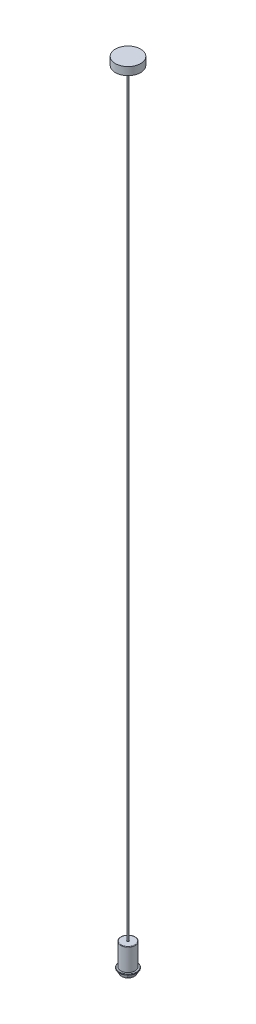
ISO-10303-21;
HEADER;
FILE_DESCRIPTION(('STEP AP214'),'2;1');
FILE_NAME('part.step','',(''),(''),'','','');
FILE_SCHEMA(('AUTOMOTIVE_DESIGN { 1 0 10303 214 1 1 1 1 }'));
ENDSEC;
DATA;
#1=APPLICATION_CONTEXT('core data for automotive mechanical design processes');
#2=APPLICATION_PROTOCOL_DEFINITION('international standard','automotive_design',2000,#1);
#3=PRODUCT_CONTEXT('',#1,'mechanical');
#4=PRODUCT('Part','Part','',(#3));
#5=PRODUCT_RELATED_PRODUCT_CATEGORY('part','',(#4));
#6=PRODUCT_DEFINITION_FORMATION('','',#4);
#7=PRODUCT_DEFINITION_CONTEXT('part definition',#1,'design');
#8=PRODUCT_DEFINITION('design','',#6,#7);
#9=PRODUCT_DEFINITION_SHAPE('','',#8);
#10=(LENGTH_UNIT() NAMED_UNIT(*) SI_UNIT(.MILLI.,.METRE.));
#11=(NAMED_UNIT(*) PLANE_ANGLE_UNIT() SI_UNIT($,.RADIAN.));
#12=(NAMED_UNIT(*) SI_UNIT($,.STERADIAN.) SOLID_ANGLE_UNIT());
#13=UNCERTAINTY_MEASURE_WITH_UNIT(LENGTH_MEASURE(1.E-05),#10,'distance_accuracy_value','');
#14=(GEOMETRIC_REPRESENTATION_CONTEXT(3) GLOBAL_UNCERTAINTY_ASSIGNED_CONTEXT((#13)) GLOBAL_UNIT_ASSIGNED_CONTEXT((#10,
#11,#12)) REPRESENTATION_CONTEXT('',''));
#15=CARTESIAN_POINT('',(0.,0.,0.));
#16=DIRECTION('',(0.,0.,1.));
#17=DIRECTION('',(1.,0.,0.));
#18=AXIS2_PLACEMENT_3D('',#15,#16,#17);
#19=CARTESIAN_POINT('',(0.,-4.3,0.));
#20=DIRECTION('',(0.,1.,0.));
#21=DIRECTION('',(0.,0.,1.));
#22=AXIS2_PLACEMENT_3D('',#19,#20,#21);
#23=CYLINDRICAL_SURFACE('',#22,28.);
#24=CARTESIAN_POINT('',(0.,-1.8,0.));
#25=DIRECTION('',(0.,-1.,0.));
#26=DIRECTION('',(0.,0.,-1.));
#27=AXIS2_PLACEMENT_3D('',#24,#25,#26);
#28=CIRCLE('',#27,28.);
#29=CARTESIAN_POINT('',(0.,-1.8,-28.));
#30=VERTEX_POINT('',#29);
#31=EDGE_CURVE('E58',#30,#30,#28,.T.);
#32=ORIENTED_EDGE('',*,*,#31,.T.);
#33=EDGE_LOOP('',(#32));
#34=FACE_BOUND('',#33,.T.);
#35=CARTESIAN_POINT('',(0.,-3.3,0.));
#36=DIRECTION('',(0.,-1.,0.));
#37=DIRECTION('',(0.,0.,-1.));
#38=AXIS2_PLACEMENT_3D('',#35,#36,#37);
#39=CIRCLE('',#38,28.);
#40=CARTESIAN_POINT('',(0.,-3.3,-28.));
#41=VERTEX_POINT('',#40);
#42=EDGE_CURVE('E62',#41,#41,#39,.F.);
#43=ORIENTED_EDGE('',*,*,#42,.T.);
#44=EDGE_LOOP('',(#43));
#45=FACE_BOUND('',#44,.T.);
#46=ADVANCED_FACE('F47',(#34,#45),#23,.T.);
#47=CARTESIAN_POINT('',(0.,-4.3,0.));
#48=DIRECTION('',(0.,-1.,0.));
#49=DIRECTION('',(0.,0.,-1.));
#50=AXIS2_PLACEMENT_3D('',#47,#48,#49);
#51=PLANE('',#50);
#52=CARTESIAN_POINT('',(0.,-4.3,0.));
#53=DIRECTION('',(0.,-1.,0.));
#54=DIRECTION('',(0.,0.,-1.));
#55=AXIS2_PLACEMENT_3D('',#52,#53,#54);
#56=CIRCLE('',#55,23.);
#57=CARTESIAN_POINT('',(0.,-4.3,-23.));
#58=VERTEX_POINT('',#57);
#59=EDGE_CURVE('E68',#58,#58,#56,.T.);
#60=ORIENTED_EDGE('',*,*,#59,.F.);
#61=EDGE_LOOP('',(#60));
#62=FACE_BOUND('',#61,.T.);
#63=CARTESIAN_POINT('',(0.,-4.3,0.));
#64=DIRECTION('',(0.,-1.,0.));
#65=DIRECTION('',(0.,0.,-1.));
#66=AXIS2_PLACEMENT_3D('',#63,#64,#65);
#67=CIRCLE('',#66,27.);
#68=CARTESIAN_POINT('',(0.,-4.3,-27.));
#69=VERTEX_POINT('',#68);
#70=EDGE_CURVE('E11',#69,#69,#67,.T.);
#71=ORIENTED_EDGE('',*,*,#70,.T.);
#72=EDGE_LOOP('',(#71));
#73=FACE_BOUND('',#72,.T.);
#74=ADVANCED_FACE('F85',(#62,#73),#51,.T.);
#75=CARTESIAN_POINT('',(0.,-0.8,0.));
#76=DIRECTION('',(0.,-1.,0.));
#77=DIRECTION('',(0.,0.,-1.));
#78=AXIS2_PLACEMENT_3D('',#75,#76,#77);
#79=PLANE('',#78);
#80=CARTESIAN_POINT('',(0.,-0.799999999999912,0.));
#81=DIRECTION('',(0.,-1.,0.));
#82=DIRECTION('',(0.,0.,-1.));
#83=AXIS2_PLACEMENT_3D('',#80,#81,#82);
#84=CIRCLE('',#83,20.);
#85=CARTESIAN_POINT('',(0.,-0.799999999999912,-20.));
#86=VERTEX_POINT('',#85);
#87=EDGE_CURVE('E76',#86,#86,#84,.F.);
#88=ORIENTED_EDGE('',*,*,#87,.F.);
#89=EDGE_LOOP('',(#88));
#90=FACE_BOUND('',#89,.T.);
#91=CARTESIAN_POINT('',(0.,-0.8,0.));
#92=DIRECTION('',(0.,-1.,0.));
#93=DIRECTION('',(0.,0.,-1.));
#94=AXIS2_PLACEMENT_3D('',#91,#92,#93);
#95=CIRCLE('',#94,27.);
#96=CARTESIAN_POINT('',(0.,-0.8,-27.));
#97=VERTEX_POINT('',#96);
#98=EDGE_CURVE('E54',#97,#97,#95,.F.);
#99=ORIENTED_EDGE('',*,*,#98,.T.);
#100=EDGE_LOOP('',(#99));
#101=FACE_BOUND('',#100,.T.);
#102=ADVANCED_FACE('F82',(#90,#101),#79,.F.);
#103=CARTESIAN_POINT('',(0.,-1.8,0.));
#104=DIRECTION('',(0.,-1.,0.));
#105=DIRECTION('',(0.,0.,-1.));
#106=AXIS2_PLACEMENT_3D('',#103,#104,#105);
#107=TOROIDAL_SURFACE('',#106,27.,1.);
#108=ORIENTED_EDGE('',*,*,#98,.F.);
#109=EDGE_LOOP('',(#108));
#110=FACE_BOUND('',#109,.T.);
#111=ORIENTED_EDGE('',*,*,#31,.F.);
#112=EDGE_LOOP('',(#111));
#113=FACE_BOUND('',#112,.T.);
#114=ADVANCED_FACE('F84',(#110,#113),#107,.T.);
#115=CARTESIAN_POINT('',(0.,-3.3,0.));
#116=DIRECTION('',(0.,-1.,0.));
#117=DIRECTION('',(0.,0.,-1.));
#118=AXIS2_PLACEMENT_3D('',#115,#116,#117);
#119=TOROIDAL_SURFACE('',#118,27.,1.);
#120=ORIENTED_EDGE('',*,*,#42,.F.);
#121=EDGE_LOOP('',(#120));
#122=FACE_BOUND('',#121,.T.);
#123=ORIENTED_EDGE('',*,*,#70,.F.);
#124=EDGE_LOOP('',(#123));
#125=FACE_BOUND('',#124,.T.);
#126=ADVANCED_FACE('F49',(#122,#125),#119,.T.);
#127=CARTESIAN_POINT('',(0.,-12.3,0.));
#128=DIRECTION('',(0.,-1.,0.));
#129=DIRECTION('',(0.,0.,-1.));
#130=AXIS2_PLACEMENT_3D('',#127,#128,#129);
#131=PLANE('',#130);
#132=CARTESIAN_POINT('',(0.,-12.3,0.));
#133=DIRECTION('',(0.,-1.,0.));
#134=DIRECTION('',(0.,0.,-1.));
#135=AXIS2_PLACEMENT_3D('',#132,#133,#134);
#136=CIRCLE('',#135,23.);
#137=CARTESIAN_POINT('',(0.,-12.3,-23.));
#138=VERTEX_POINT('',#137);
#139=EDGE_CURVE('E67',#138,#138,#136,.T.);
#140=ORIENTED_EDGE('',*,*,#139,.T.);
#141=EDGE_LOOP('',(#140));
#142=FACE_BOUND('',#141,.T.);
#143=CARTESIAN_POINT('',(0.,-12.3,0.));
#144=DIRECTION('',(0.,-1.,0.));
#145=DIRECTION('',(0.,0.,-1.));
#146=AXIS2_PLACEMENT_3D('',#143,#144,#145);
#147=CIRCLE('',#146,20.);
#148=CARTESIAN_POINT('',(0.,-12.3,-20.));
#149=VERTEX_POINT('',#148);
#150=EDGE_CURVE('E71',#149,#149,#147,.T.);
#151=ORIENTED_EDGE('',*,*,#150,.F.);
#152=EDGE_LOOP('',(#151));
#153=FACE_BOUND('',#152,.T.);
#154=ADVANCED_FACE('F105',(#142,#153),#131,.T.);
#155=CARTESIAN_POINT('',(0.,-12.3,0.));
#156=DIRECTION('',(0.,1.,0.));
#157=DIRECTION('',(0.,0.,1.));
#158=AXIS2_PLACEMENT_3D('',#155,#156,#157);
#159=CYLINDRICAL_SURFACE('',#158,23.);
#160=ORIENTED_EDGE('',*,*,#139,.F.);
#161=EDGE_LOOP('',(#160));
#162=FACE_BOUND('',#161,.T.);
#163=ORIENTED_EDGE('',*,*,#59,.T.);
#164=EDGE_LOOP('',(#163));
#165=FACE_BOUND('',#164,.T.);
#166=ADVANCED_FACE('F109',(#162,#165),#159,.T.);
#167=CARTESIAN_POINT('',(0.,-12.3,0.));
#168=DIRECTION('',(0.,1.,0.));
#169=DIRECTION('',(0.,0.,1.));
#170=AXIS2_PLACEMENT_3D('',#167,#168,#169);
#171=CYLINDRICAL_SURFACE('',#170,20.);
#172=ORIENTED_EDGE('',*,*,#150,.T.);
#173=EDGE_LOOP('',(#172));
#174=FACE_BOUND('',#173,.T.);
#175=ORIENTED_EDGE('',*,*,#87,.T.);
#176=EDGE_LOOP('',(#175));
#177=FACE_BOUND('',#176,.T.);
#178=ADVANCED_FACE('F80',(#174,#177),#171,.F.);
#179=CLOSED_SHELL('',(#46,#74,#102,#114,#126,#154,#166,#178));
#180=MANIFOLD_SOLID_BREP('B2',#179);
#181=CARTESIAN_POINT('',(0.,71.,0.));
#182=DIRECTION('',(0.,-1.,0.));
#183=DIRECTION('',(0.,0.,-1.));
#184=AXIS2_PLACEMENT_3D('',#181,#182,#183);
#185=CYLINDRICAL_SURFACE('',#184,23.);
#186=CARTESIAN_POINT('',(0.,69.5,0.));
#187=DIRECTION('',(0.,1.,0.));
#188=DIRECTION('',(0.,0.,1.));
#189=AXIS2_PLACEMENT_3D('',#186,#187,#188);
#190=CIRCLE('',#189,23.);
#191=CARTESIAN_POINT('',(0.,69.5,23.));
#192=VERTEX_POINT('',#191);
#193=EDGE_CURVE('E46',#192,#192,#190,.F.);
#194=ORIENTED_EDGE('',*,*,#193,.T.);
#195=EDGE_LOOP('',(#194));
#196=FACE_BOUND('',#195,.T.);
#197=CARTESIAN_POINT('',(0.,0.,0.));
#198=DIRECTION('',(0.,1.,0.));
#199=DIRECTION('',(0.,0.,1.));
#200=AXIS2_PLACEMENT_3D('',#197,#198,#199);
#201=CIRCLE('',#200,23.);
#202=CARTESIAN_POINT('',(0.,0.,23.));
#203=VERTEX_POINT('',#202);
#204=EDGE_CURVE('E185',#203,#203,#201,.T.);
#205=ORIENTED_EDGE('',*,*,#204,.T.);
#206=EDGE_LOOP('',(#205));
#207=FACE_BOUND('',#206,.T.);
#208=ADVANCED_FACE('F172',(#196,#207),#185,.T.);
#209=CARTESIAN_POINT('',(0.,71.,0.));
#210=DIRECTION('',(0.,1.,0.));
#211=DIRECTION('',(0.,0.,1.));
#212=AXIS2_PLACEMENT_3D('',#209,#210,#211);
#213=PLANE('',#212);
#214=CARTESIAN_POINT('',(0.,71.,0.));
#215=DIRECTION('',(0.,1.,0.));
#216=DIRECTION('',(0.,0.,1.));
#217=AXIS2_PLACEMENT_3D('',#214,#215,#216);
#218=CIRCLE('',#217,3.5);
#219=CARTESIAN_POINT('',(0.,71.,3.5));
#220=VERTEX_POINT('',#219);
#221=EDGE_CURVE('E193',#220,#220,#218,.T.);
#222=ORIENTED_EDGE('',*,*,#221,.F.);
#223=EDGE_LOOP('',(#222));
#224=FACE_BOUND('',#223,.T.);
#225=CARTESIAN_POINT('',(0.,71.,0.));
#226=DIRECTION('',(0.,1.,0.));
#227=DIRECTION('',(0.,0.,1.));
#228=AXIS2_PLACEMENT_3D('',#225,#226,#227);
#229=CIRCLE('',#228,21.5);
#230=CARTESIAN_POINT('',(0.,71.,21.5));
#231=VERTEX_POINT('',#230);
#232=EDGE_CURVE('E180',#231,#231,#229,.T.);
#233=ORIENTED_EDGE('',*,*,#232,.T.);
#234=EDGE_LOOP('',(#233));
#235=FACE_BOUND('',#234,.T.);
#236=ADVANCED_FACE('F293',(#224,#235),#213,.T.);
#237=CARTESIAN_POINT('',(0.,0.,0.));
#238=DIRECTION('',(0.,1.,0.));
#239=DIRECTION('',(0.,0.,1.));
#240=AXIS2_PLACEMENT_3D('',#237,#238,#239);
#241=PLANE('',#240);
#242=CARTESIAN_POINT('',(0.,0.,0.));
#243=DIRECTION('',(0.,-1.,0.));
#244=DIRECTION('',(0.,0.,-1.));
#245=AXIS2_PLACEMENT_3D('',#242,#243,#244);
#246=CIRCLE('',#245,22.5);
#247=CARTESIAN_POINT('',(0.,0.,-22.5));
#248=VERTEX_POINT('',#247);
#249=EDGE_CURVE('E233',#248,#248,#246,.T.);
#250=ORIENTED_EDGE('',*,*,#249,.F.);
#251=EDGE_LOOP('',(#250));
#252=FACE_BOUND('',#251,.T.);
#253=ORIENTED_EDGE('',*,*,#204,.F.);
#254=EDGE_LOOP('',(#253));
#255=FACE_BOUND('',#254,.T.);
#256=ADVANCED_FACE('F290',(#252,#255),#241,.F.);
#257=CARTESIAN_POINT('',(0.,69.5,0.));
#258=DIRECTION('',(0.,1.,0.));
#259=DIRECTION('',(0.,0.,1.));
#260=AXIS2_PLACEMENT_3D('',#257,#258,#259);
#261=TOROIDAL_SURFACE('',#260,21.5,1.5);
#262=ORIENTED_EDGE('',*,*,#193,.F.);
#263=EDGE_LOOP('',(#262));
#264=FACE_BOUND('',#263,.T.);
#265=ORIENTED_EDGE('',*,*,#232,.F.);
#266=EDGE_LOOP('',(#265));
#267=FACE_BOUND('',#266,.T.);
#268=ADVANCED_FACE('F174',(#264,#267),#261,.T.);
#269=CARTESIAN_POINT('',(0.,69.5,0.));
#270=DIRECTION('',(0.,1.,0.));
#271=DIRECTION('',(0.,0.,1.));
#272=AXIS2_PLACEMENT_3D('',#269,#270,#271);
#273=CYLINDRICAL_SURFACE('',#272,3.5);
#274=CARTESIAN_POINT('',(0.,69.5,0.));
#275=DIRECTION('',(0.,1.,0.));
#276=DIRECTION('',(0.,0.,1.));
#277=AXIS2_PLACEMENT_3D('',#274,#275,#276);
#278=CIRCLE('',#277,3.5);
#279=CARTESIAN_POINT('',(0.,69.5,3.5));
#280=VERTEX_POINT('',#279);
#281=EDGE_CURVE('E190',#280,#280,#278,.T.);
#282=ORIENTED_EDGE('',*,*,#281,.F.);
#283=EDGE_LOOP('',(#282));
#284=FACE_BOUND('',#283,.T.);
#285=ORIENTED_EDGE('',*,*,#221,.T.);
#286=EDGE_LOOP('',(#285));
#287=FACE_BOUND('',#286,.T.);
#288=ADVANCED_FACE('F304',(#284,#287),#273,.F.);
#289=CARTESIAN_POINT('',(0.,69.5,0.));
#290=DIRECTION('',(0.,1.,0.));
#291=DIRECTION('',(0.,0.,1.));
#292=AXIS2_PLACEMENT_3D('',#289,#290,#291);
#293=PLANE('',#292);
#294=CARTESIAN_POINT('',(0.,69.5,0.));
#295=DIRECTION('',(0.,1.,0.));
#296=DIRECTION('',(0.,0.,1.));
#297=AXIS2_PLACEMENT_3D('',#294,#295,#296);
#298=CIRCLE('',#297,2.5);
#299=CARTESIAN_POINT('',(0.,69.5,2.5));
#300=VERTEX_POINT('',#299);
#301=EDGE_CURVE('E201',#300,#300,#298,.T.);
#302=ORIENTED_EDGE('',*,*,#301,.F.);
#303=EDGE_LOOP('',(#302));
#304=FACE_BOUND('',#303,.T.);
#305=ORIENTED_EDGE('',*,*,#281,.T.);
#306=EDGE_LOOP('',(#305));
#307=FACE_BOUND('',#306,.T.);
#308=ADVANCED_FACE('F307',(#304,#307),#293,.T.);
#309=CARTESIAN_POINT('',(0.,66.5,0.));
#310=DIRECTION('',(0.,1.,0.));
#311=DIRECTION('',(0.,0.,1.));
#312=AXIS2_PLACEMENT_3D('',#309,#310,#311);
#313=CYLINDRICAL_SURFACE('',#312,2.5);
#314=CARTESIAN_POINT('',(0.,66.5,0.));
#315=DIRECTION('',(0.,1.,0.));
#316=DIRECTION('',(0.,0.,1.));
#317=AXIS2_PLACEMENT_3D('',#314,#315,#316);
#318=CIRCLE('',#317,2.5);
#319=CARTESIAN_POINT('',(0.,66.5,2.5));
#320=VERTEX_POINT('',#319);
#321=EDGE_CURVE('E197',#320,#320,#318,.T.);
#322=ORIENTED_EDGE('',*,*,#321,.F.);
#323=EDGE_LOOP('',(#322));
#324=FACE_BOUND('',#323,.T.);
#325=ORIENTED_EDGE('',*,*,#301,.T.);
#326=EDGE_LOOP('',(#325));
#327=FACE_BOUND('',#326,.T.);
#328=ADVANCED_FACE('F311',(#324,#327),#313,.F.);
#329=CARTESIAN_POINT('',(0.,66.5,0.));
#330=DIRECTION('',(0.,1.,0.));
#331=DIRECTION('',(0.,0.,1.));
#332=AXIS2_PLACEMENT_3D('',#329,#330,#331);
#333=PLANE('',#332);
#334=CARTESIAN_POINT('',(0.,66.5,0.));
#335=DIRECTION('',(0.,1.,0.));
#336=DIRECTION('',(0.,0.,1.));
#337=AXIS2_PLACEMENT_3D('',#334,#335,#336);
#338=CIRCLE('',#337,2.);
#339=CARTESIAN_POINT('',(0.,66.5,2.));
#340=VERTEX_POINT('',#339);
#341=EDGE_CURVE('E209',#340,#340,#338,.T.);
#342=ORIENTED_EDGE('',*,*,#341,.F.);
#343=EDGE_LOOP('',(#342));
#344=FACE_BOUND('',#343,.T.);
#345=ORIENTED_EDGE('',*,*,#321,.T.);
#346=EDGE_LOOP('',(#345));
#347=FACE_BOUND('',#346,.T.);
#348=ADVANCED_FACE('F315',(#344,#347),#333,.T.);
#349=CARTESIAN_POINT('',(0.,2466.5,0.));
#350=DIRECTION('',(0.,-1.,0.));
#351=DIRECTION('',(0.,0.,-1.));
#352=AXIS2_PLACEMENT_3D('',#349,#350,#351);
#353=CYLINDRICAL_SURFACE('',#352,2.);
#354=CARTESIAN_POINT('',(0.,2466.5,0.));
#355=DIRECTION('',(0.,1.,0.));
#356=DIRECTION('',(0.,0.,1.));
#357=AXIS2_PLACEMENT_3D('',#354,#355,#356);
#358=CIRCLE('',#357,2.);
#359=CARTESIAN_POINT('',(0.,2466.5,2.));
#360=VERTEX_POINT('',#359);
#361=EDGE_CURVE('E205',#360,#360,#358,.T.);
#362=ORIENTED_EDGE('',*,*,#361,.F.);
#363=EDGE_LOOP('',(#362));
#364=FACE_BOUND('',#363,.T.);
#365=ORIENTED_EDGE('',*,*,#341,.T.);
#366=EDGE_LOOP('',(#365));
#367=FACE_BOUND('',#366,.T.);
#368=ADVANCED_FACE('F319',(#364,#367),#353,.T.);
#369=CARTESIAN_POINT('',(0.,2476.5,0.));
#370=DIRECTION('',(0.,-1.,0.));
#371=DIRECTION('',(0.,0.,-1.));
#372=AXIS2_PLACEMENT_3D('',#369,#370,#371);
#373=CYLINDRICAL_SURFACE('',#372,6.5);
#374=CARTESIAN_POINT('',(0.,2476.5,0.));
#375=DIRECTION('',(0.,1.,0.));
#376=DIRECTION('',(0.,0.,1.));
#377=AXIS2_PLACEMENT_3D('',#374,#375,#376);
#378=CIRCLE('',#377,6.5);
#379=CARTESIAN_POINT('',(0.,2476.5,6.5));
#380=VERTEX_POINT('',#379);
#381=EDGE_CURVE('E213',#380,#380,#378,.T.);
#382=ORIENTED_EDGE('',*,*,#381,.F.);
#383=EDGE_LOOP('',(#382));
#384=FACE_BOUND('',#383,.T.);
#385=CARTESIAN_POINT('',(0.,2466.5,0.));
#386=DIRECTION('',(0.,1.,0.));
#387=DIRECTION('',(0.,0.,1.));
#388=AXIS2_PLACEMENT_3D('',#385,#386,#387);
#389=CIRCLE('',#388,6.5);
#390=CARTESIAN_POINT('',(0.,2466.5,6.5));
#391=VERTEX_POINT('',#390);
#392=EDGE_CURVE('E217',#391,#391,#389,.T.);
#393=ORIENTED_EDGE('',*,*,#392,.T.);
#394=EDGE_LOOP('',(#393));
#395=FACE_BOUND('',#394,.T.);
#396=ADVANCED_FACE('F323',(#384,#395),#373,.T.);
#397=CARTESIAN_POINT('',(0.,2466.5,0.));
#398=DIRECTION('',(0.,1.,0.));
#399=DIRECTION('',(0.,0.,1.));
#400=AXIS2_PLACEMENT_3D('',#397,#398,#399);
#401=PLANE('',#400);
#402=ORIENTED_EDGE('',*,*,#361,.T.);
#403=EDGE_LOOP('',(#402));
#404=FACE_BOUND('',#403,.T.);
#405=ORIENTED_EDGE('',*,*,#392,.F.);
#406=EDGE_LOOP('',(#405));
#407=FACE_BOUND('',#406,.T.);
#408=ADVANCED_FACE('F327',(#404,#407),#401,.F.);
#409=CARTESIAN_POINT('',(0.,2501.5,0.));
#410=DIRECTION('',(0.,-1.,0.));
#411=DIRECTION('',(0.,0.,-1.));
#412=AXIS2_PLACEMENT_3D('',#409,#410,#411);
#413=CYLINDRICAL_SURFACE('',#412,40.);
#414=CARTESIAN_POINT('',(0.,2501.5,0.));
#415=DIRECTION('',(0.,1.,0.));
#416=DIRECTION('',(0.,0.,1.));
#417=AXIS2_PLACEMENT_3D('',#414,#415,#416);
#418=CIRCLE('',#417,40.);
#419=CARTESIAN_POINT('',(0.,2501.5,40.));
#420=VERTEX_POINT('',#419);
#421=EDGE_CURVE('E221',#420,#420,#418,.T.);
#422=ORIENTED_EDGE('',*,*,#421,.F.);
#423=EDGE_LOOP('',(#422));
#424=FACE_BOUND('',#423,.T.);
#425=CARTESIAN_POINT('',(0.,2476.5,0.));
#426=DIRECTION('',(0.,1.,0.));
#427=DIRECTION('',(0.,0.,1.));
#428=AXIS2_PLACEMENT_3D('',#425,#426,#427);
#429=CIRCLE('',#428,40.);
#430=CARTESIAN_POINT('',(0.,2476.5,40.));
#431=VERTEX_POINT('',#430);
#432=EDGE_CURVE('E225',#431,#431,#429,.T.);
#433=ORIENTED_EDGE('',*,*,#432,.T.);
#434=EDGE_LOOP('',(#433));
#435=FACE_BOUND('',#434,.T.);
#436=ADVANCED_FACE('F331',(#424,#435),#413,.T.);
#437=CARTESIAN_POINT('',(0.,2501.5,0.));
#438=DIRECTION('',(0.,1.,0.));
#439=DIRECTION('',(0.,0.,1.));
#440=AXIS2_PLACEMENT_3D('',#437,#438,#439);
#441=PLANE('',#440);
#442=ORIENTED_EDGE('',*,*,#421,.T.);
#443=EDGE_LOOP('',(#442));
#444=FACE_BOUND('',#443,.T.);
#445=ADVANCED_FACE('F335',(#444),#441,.T.);
#446=CARTESIAN_POINT('',(0.,2476.5,0.));
#447=DIRECTION('',(0.,1.,0.));
#448=DIRECTION('',(0.,0.,1.));
#449=AXIS2_PLACEMENT_3D('',#446,#447,#448);
#450=PLANE('',#449);
#451=ORIENTED_EDGE('',*,*,#381,.T.);
#452=EDGE_LOOP('',(#451));
#453=FACE_BOUND('',#452,.T.);
#454=ORIENTED_EDGE('',*,*,#432,.F.);
#455=EDGE_LOOP('',(#454));
#456=FACE_BOUND('',#455,.T.);
#457=ADVANCED_FACE('F286',(#453,#456),#450,.F.);
#458=CARTESIAN_POINT('',(0.,35.,0.));
#459=DIRECTION('',(0.,-1.,0.));
#460=DIRECTION('',(0.,0.,-1.));
#461=AXIS2_PLACEMENT_3D('',#458,#459,#460);
#462=CYLINDRICAL_SURFACE('',#461,22.5);
#463=CARTESIAN_POINT('',(0.,35.,0.));
#464=DIRECTION('',(0.,-1.,0.));
#465=DIRECTION('',(0.,0.,-1.));
#466=AXIS2_PLACEMENT_3D('',#463,#464,#465);
#467=CIRCLE('',#466,22.5);
#468=CARTESIAN_POINT('',(0.,35.,-22.5));
#469=VERTEX_POINT('',#468);
#470=EDGE_CURVE('E229',#469,#469,#467,.T.);
#471=ORIENTED_EDGE('',*,*,#470,.F.);
#472=EDGE_LOOP('',(#471));
#473=FACE_BOUND('',#472,.T.);
#474=ORIENTED_EDGE('',*,*,#249,.T.);
#475=EDGE_LOOP('',(#474));
#476=FACE_BOUND('',#475,.T.);
#477=ADVANCED_FACE('F280',(#473,#476),#462,.F.);
#478=CARTESIAN_POINT('',(0.,35.,0.));
#479=DIRECTION('',(0.,-1.,0.));
#480=DIRECTION('',(0.,0.,-1.));
#481=AXIS2_PLACEMENT_3D('',#478,#479,#480);
#482=PLANE('',#481);
#483=CARTESIAN_POINT('',(0.,35.,0.));
#484=DIRECTION('',(0.,-1.,0.));
#485=DIRECTION('',(0.,0.,-1.));
#486=AXIS2_PLACEMENT_3D('',#483,#484,#485);
#487=CIRCLE('',#486,20.);
#488=CARTESIAN_POINT('',(0.,35.,20.));
#489=VERTEX_POINT('',#488);
#490=EDGE_CURVE('E241',#489,#489,#487,.T.);
#491=ORIENTED_EDGE('',*,*,#490,.F.);
#492=EDGE_LOOP('',(#491));
#493=FACE_BOUND('',#492,.T.);
#494=ORIENTED_EDGE('',*,*,#470,.T.);
#495=EDGE_LOOP('',(#494));
#496=FACE_BOUND('',#495,.T.);
#497=ADVANCED_FACE('F274',(#493,#496),#482,.T.);
#498=CARTESIAN_POINT('',(0.,-17.,0.));
#499=DIRECTION('',(0.,1.,0.));
#500=DIRECTION('',(0.,0.,1.));
#501=AXIS2_PLACEMENT_3D('',#498,#499,#500);
#502=CYLINDRICAL_SURFACE('',#501,20.);
#503=CARTESIAN_POINT('',(0.,-17.,0.));
#504=DIRECTION('',(0.,-1.,0.));
#505=DIRECTION('',(0.,0.,-1.));
#506=AXIS2_PLACEMENT_3D('',#503,#504,#505);
#507=CIRCLE('',#506,20.);
#508=CARTESIAN_POINT('',(0.,-17.,20.));
#509=VERTEX_POINT('',#508);
#510=EDGE_CURVE('E237',#509,#509,#507,.T.);
#511=CARTESIAN_POINT('',(0.,-17.,20.));
#512=CARTESIAN_POINT('',(0.,-16.4583333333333,20.));
#513=CARTESIAN_POINT('',(0.,-15.9166666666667,20.));
#514=CARTESIAN_POINT('',(0.,-14.8333333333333,20.));
#515=CARTESIAN_POINT('',(0.,-14.2916666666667,20.));
#516=CARTESIAN_POINT('',(0.,-13.2083333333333,20.));
#517=CARTESIAN_POINT('',(0.,-12.6666666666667,20.));
#518=CARTESIAN_POINT('',(0.,-11.5833333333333,20.));
#519=CARTESIAN_POINT('',(0.,-11.0416666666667,20.));
#520=CARTESIAN_POINT('',(0.,-9.95833333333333,20.));
#521=CARTESIAN_POINT('',(0.,-9.41666666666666,20.));
#522=CARTESIAN_POINT('',(0.,-8.33333333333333,20.));
#523=CARTESIAN_POINT('',(0.,-7.79166666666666,20.));
#524=CARTESIAN_POINT('',(0.,-6.70833333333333,20.));
#525=CARTESIAN_POINT('',(0.,-6.16666666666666,20.));
#526=CARTESIAN_POINT('',(0.,-5.08333333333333,20.));
#527=CARTESIAN_POINT('',(0.,-4.54166666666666,20.));
#528=CARTESIAN_POINT('',(0.,-3.45833333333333,20.));
#529=CARTESIAN_POINT('',(0.,-2.91666666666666,20.));
#530=CARTESIAN_POINT('',(0.,-1.83333333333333,20.));
#531=CARTESIAN_POINT('',(0.,-1.29166666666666,20.));
#532=CARTESIAN_POINT('',(0.,-0.208333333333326,20.));
#533=CARTESIAN_POINT('',(0.,0.333333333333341,20.));
#534=CARTESIAN_POINT('',(0.,1.41666666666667,20.));
#535=CARTESIAN_POINT('',(0.,1.95833333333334,20.));
#536=CARTESIAN_POINT('',(0.,3.04166666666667,20.));
#537=CARTESIAN_POINT('',(0.,3.58333333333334,20.));
#538=CARTESIAN_POINT('',(0.,4.66666666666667,20.));
#539=CARTESIAN_POINT('',(0.,5.20833333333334,20.));
#540=CARTESIAN_POINT('',(0.,6.29166666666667,20.));
#541=CARTESIAN_POINT('',(0.,6.83333333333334,20.));
#542=CARTESIAN_POINT('',(0.,7.91666666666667,20.));
#543=CARTESIAN_POINT('',(0.,8.45833333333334,20.));
#544=CARTESIAN_POINT('',(0.,9.54166666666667,20.));
#545=CARTESIAN_POINT('',(0.,10.0833333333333,20.));
#546=CARTESIAN_POINT('',(0.,11.1666666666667,20.));
#547=CARTESIAN_POINT('',(0.,11.7083333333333,20.));
#548=CARTESIAN_POINT('',(0.,12.7916666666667,20.));
#549=CARTESIAN_POINT('',(0.,13.3333333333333,20.));
#550=CARTESIAN_POINT('',(0.,14.4166666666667,20.));
#551=CARTESIAN_POINT('',(0.,14.9583333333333,20.));
#552=CARTESIAN_POINT('',(0.,16.0416666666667,20.));
#553=CARTESIAN_POINT('',(0.,16.5833333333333,20.));
#554=CARTESIAN_POINT('',(0.,17.6666666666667,20.));
#555=CARTESIAN_POINT('',(0.,18.2083333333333,20.));
#556=CARTESIAN_POINT('',(0.,19.2916666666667,20.));
#557=CARTESIAN_POINT('',(0.,19.8333333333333,20.));
#558=CARTESIAN_POINT('',(0.,20.9166666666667,20.));
#559=CARTESIAN_POINT('',(0.,21.4583333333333,20.));
#560=CARTESIAN_POINT('',(0.,22.5416666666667,20.));
#561=CARTESIAN_POINT('',(0.,23.0833333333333,20.));
#562=CARTESIAN_POINT('',(0.,24.1666666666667,20.));
#563=CARTESIAN_POINT('',(0.,24.7083333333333,20.));
#564=CARTESIAN_POINT('',(0.,25.7916666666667,20.));
#565=CARTESIAN_POINT('',(0.,26.3333333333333,20.));
#566=CARTESIAN_POINT('',(0.,27.4166666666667,20.));
#567=CARTESIAN_POINT('',(0.,27.9583333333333,20.));
#568=CARTESIAN_POINT('',(0.,29.0416666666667,20.));
#569=CARTESIAN_POINT('',(0.,29.5833333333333,20.));
#570=CARTESIAN_POINT('',(0.,30.6666666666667,20.));
#571=CARTESIAN_POINT('',(0.,31.2083333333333,20.));
#572=CARTESIAN_POINT('',(0.,32.2916666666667,20.));
#573=CARTESIAN_POINT('',(0.,32.8333333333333,20.));
#574=CARTESIAN_POINT('',(0.,33.9166666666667,20.));
#575=CARTESIAN_POINT('',(0.,34.4583333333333,20.));
#576=CARTESIAN_POINT('',(0.,35.,20.));
#577=B_SPLINE_CURVE_WITH_KNOTS('',3,(#511,#512,#513,#514,#515,#516,#517,#518,#519,#520,#521,
#522,#523,#524,#525,#526,#527,#528,#529,#530,#531,#532,#533,#534,#535,#536,#537,#538,#539,#540,
#541,#542,#543,#544,#545,#546,#547,#548,#549,#550,#551,#552,#553,#554,#555,#556,#557,#558,#559,
#560,#561,#562,#563,#564,#565,#566,#567,#568,#569,#570,#571,#572,#573,#574,#575,#576),
.UNSPECIFIED.,.F.,.F.,(4,2,2,2,2,2,2,2,2,2,2,2,2,2,2,2,2,2,2,2,2,2,2,2,2,2,2,2,2,2,2,2,4),(0.,
1.625,3.25,4.875,6.5,8.125,9.75,11.375,13.,14.625,16.25,17.875,19.5,21.125,22.75,24.375,26.,
27.625,29.25,30.875,32.5,34.125,35.75,37.375,39.,40.625,42.25,43.875,45.5,47.125,48.75,50.375,
52.),.UNSPECIFIED.);
#578=EDGE_CURVE('BSEAM268',#509,#489,#577,.T.);
#579=ORIENTED_EDGE('',*,*,#510,.F.);
#580=ORIENTED_EDGE('',*,*,#490,.T.);
#581=ORIENTED_EDGE('',*,*,#578,.T.);
#582=ORIENTED_EDGE('',*,*,#578,.F.);
#583=EDGE_LOOP('',(#579,#581,#580,#582));
#584=FACE_BOUND('',#583,.T.);
#585=ADVANCED_FACE('F268',(#584),#502,.T.);
#586=CARTESIAN_POINT('',(0.,-17.,0.));
#587=DIRECTION('',(0.,-1.,0.));
#588=DIRECTION('',(0.,0.,-1.));
#589=AXIS2_PLACEMENT_3D('',#586,#587,#588);
#590=PLANE('',#589);
#591=CARTESIAN_POINT('',(0.,-17.,0.));
#592=DIRECTION('',(0.,-1.,0.));
#593=DIRECTION('',(0.,0.,-1.));
#594=AXIS2_PLACEMENT_3D('',#591,#592,#593);
#595=CIRCLE('',#594,19.);
#596=CARTESIAN_POINT('',(0.,-17.,-19.));
#597=VERTEX_POINT('',#596);
#598=EDGE_CURVE('E249',#597,#597,#595,.T.);
#599=ORIENTED_EDGE('',*,*,#598,.F.);
#600=EDGE_LOOP('',(#599));
#601=FACE_BOUND('',#600,.T.);
#602=ORIENTED_EDGE('',*,*,#510,.T.);
#603=EDGE_LOOP('',(#602));
#604=FACE_BOUND('',#603,.T.);
#605=ADVANCED_FACE('F262',(#601,#604),#590,.T.);
#606=CARTESIAN_POINT('',(0.,41.,0.));
#607=DIRECTION('',(0.,-1.,0.));
#608=DIRECTION('',(0.,0.,-1.));
#609=AXIS2_PLACEMENT_3D('',#606,#607,#608);
#610=CYLINDRICAL_SURFACE('',#609,19.);
#611=CARTESIAN_POINT('',(0.,41.,0.));
#612=DIRECTION('',(0.,-1.,0.));
#613=DIRECTION('',(0.,0.,-1.));
#614=AXIS2_PLACEMENT_3D('',#611,#612,#613);
#615=CIRCLE('',#614,19.);
#616=CARTESIAN_POINT('',(0.,41.,-19.));
#617=VERTEX_POINT('',#616);
#618=EDGE_CURVE('E245',#617,#617,#615,.T.);
#619=ORIENTED_EDGE('',*,*,#618,.F.);
#620=EDGE_LOOP('',(#619));
#621=FACE_BOUND('',#620,.T.);
#622=ORIENTED_EDGE('',*,*,#598,.T.);
#623=EDGE_LOOP('',(#622));
#624=FACE_BOUND('',#623,.T.);
#625=ADVANCED_FACE('F259',(#621,#624),#610,.F.);
#626=CARTESIAN_POINT('',(0.,41.,0.));
#627=DIRECTION('',(0.,-1.,0.));
#628=DIRECTION('',(0.,0.,-1.));
#629=AXIS2_PLACEMENT_3D('',#626,#627,#628);
#630=PLANE('',#629);
#631=ORIENTED_EDGE('',*,*,#618,.T.);
#632=EDGE_LOOP('',(#631));
#633=FACE_BOUND('',#632,.T.);
#634=ADVANCED_FACE('F257',(#633),#630,.T.);
#635=CLOSED_SHELL('',(#208,#236,#256,#268,#288,#308,#328,#348,#368,#396,#408,#436,#445,#457,
#477,#497,#585,#605,#625,#634));
#636=MANIFOLD_SOLID_BREP('B6',#635);
#637=ADVANCED_BREP_SHAPE_REPRESENTATION('',(#18,#180,#636),#14);
#638=SHAPE_DEFINITION_REPRESENTATION(#9,#637);
ENDSEC;
END-ISO-10303-21;
